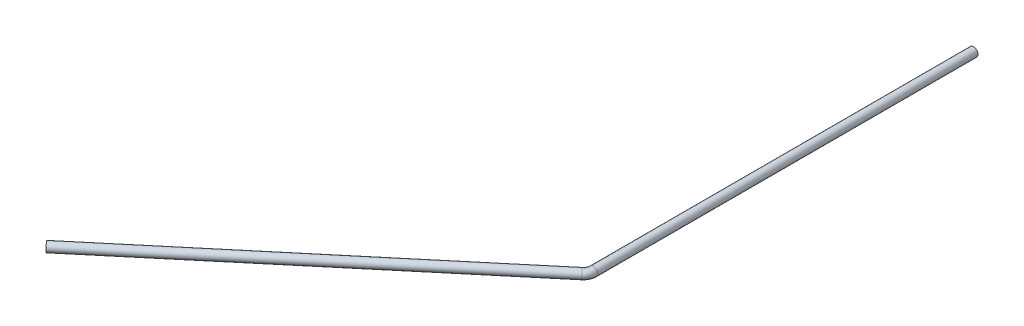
ISO-10303-21;
HEADER;
FILE_DESCRIPTION(('STEP AP214'),'2;1');
FILE_NAME('part.step','',(''),(''),'','','');
FILE_SCHEMA(('AUTOMOTIVE_DESIGN { 1 0 10303 214 1 1 1 1 }'));
ENDSEC;
DATA;
#1=APPLICATION_CONTEXT('core data for automotive mechanical design processes');
#2=APPLICATION_PROTOCOL_DEFINITION('international standard','automotive_design',2000,#1);
#3=PRODUCT_CONTEXT('',#1,'mechanical');
#4=PRODUCT('Part','Part','',(#3));
#5=PRODUCT_RELATED_PRODUCT_CATEGORY('part','',(#4));
#6=PRODUCT_DEFINITION_FORMATION('','',#4);
#7=PRODUCT_DEFINITION_CONTEXT('part definition',#1,'design');
#8=PRODUCT_DEFINITION('design','',#6,#7);
#9=PRODUCT_DEFINITION_SHAPE('','',#8);
#10=(LENGTH_UNIT() NAMED_UNIT(*) SI_UNIT(.MILLI.,.METRE.));
#11=(NAMED_UNIT(*) PLANE_ANGLE_UNIT() SI_UNIT($,.RADIAN.));
#12=(NAMED_UNIT(*) SI_UNIT($,.STERADIAN.) SOLID_ANGLE_UNIT());
#13=UNCERTAINTY_MEASURE_WITH_UNIT(LENGTH_MEASURE(1.E-05),#10,'distance_accuracy_value','');
#14=(GEOMETRIC_REPRESENTATION_CONTEXT(3) GLOBAL_UNCERTAINTY_ASSIGNED_CONTEXT((#13)) GLOBAL_UNIT_ASSIGNED_CONTEXT((#10,
#11,#12)) REPRESENTATION_CONTEXT('',''));
#15=CARTESIAN_POINT('',(0.,0.,0.));
#16=DIRECTION('',(0.,0.,1.));
#17=DIRECTION('',(1.,0.,0.));
#18=AXIS2_PLACEMENT_3D('',#15,#16,#17);
#19=CARTESIAN_POINT('',(0.,0.,0.));
#20=DIRECTION('',(0.,0.,-1.));
#21=DIRECTION('',(-1.,0.,0.));
#22=AXIS2_PLACEMENT_3D('',#19,#20,#21);
#23=PLANE('',#22);
#24=CARTESIAN_POINT('',(0.,0.,0.));
#25=DIRECTION('',(0.,0.,1.));
#26=DIRECTION('',(1.,0.,0.));
#27=AXIS2_PLACEMENT_3D('',#24,#25,#26);
#28=CIRCLE('',#27,4.);
#29=CARTESIAN_POINT('',(4.,0.,0.));
#30=VERTEX_POINT('',#29);
#31=EDGE_CURVE('E18',#30,#30,#28,.T.);
#32=ORIENTED_EDGE('',*,*,#31,.F.);
#33=EDGE_LOOP('',(#32));
#34=FACE_BOUND('',#33,.T.);
#35=ADVANCED_FACE('F15',(#34),#23,.T.);
#36=CARTESIAN_POINT('',(0.,0.,0.));
#37=DIRECTION('',(0.,0.,1.));
#38=DIRECTION('',(1.,0.,0.));
#39=AXIS2_PLACEMENT_3D('',#36,#37,#38);
#40=CYLINDRICAL_SURFACE('',#39,4.);
#41=ORIENTED_EDGE('',*,*,#31,.T.);
#42=EDGE_LOOP('',(#41));
#43=FACE_BOUND('',#42,.T.);
#44=CARTESIAN_POINT('',(0.,0.,345.803231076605));
#45=DIRECTION('',(0.,0.,1.));
#46=DIRECTION('',(1.,0.,0.));
#47=AXIS2_PLACEMENT_3D('',#44,#45,#46);
#48=CIRCLE('',#47,4.);
#49=CARTESIAN_POINT('',(4.,0.,345.803231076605));
#50=VERTEX_POINT('',#49);
#51=EDGE_CURVE('E27',#50,#50,#48,.T.);
#52=ORIENTED_EDGE('',*,*,#51,.F.);
#53=EDGE_LOOP('',(#52));
#54=FACE_BOUND('',#53,.T.);
#55=ADVANCED_FACE('F43',(#43,#54),#40,.T.);
#56=CARTESIAN_POINT('',(-268.115555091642,0.,574.975663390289));
#57=DIRECTION('',(0.766044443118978,0.,-0.64278760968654));
#58=DIRECTION('',(-0.64278760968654,0.,-0.766044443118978));
#59=AXIS2_PLACEMENT_3D('',#56,#57,#58);
#60=PLANE('',#59);
#61=CARTESIAN_POINT('',(-268.115555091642,0.,574.975663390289));
#62=DIRECTION('',(-0.766044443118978,0.,0.64278760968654));
#63=DIRECTION('',(0.64278760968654,0.,0.766044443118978));
#64=AXIS2_PLACEMENT_3D('',#61,#62,#63);
#65=CIRCLE('',#64,4.);
#66=CARTESIAN_POINT('',(-265.544404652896,0.,578.039841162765));
#67=VERTEX_POINT('',#66);
#68=EDGE_CURVE('E22',#67,#67,#65,.F.);
#69=ORIENTED_EDGE('',*,*,#68,.F.);
#70=EDGE_LOOP('',(#69));
#71=FACE_BOUND('',#70,.T.);
#72=ADVANCED_FACE('F40',(#71),#60,.F.);
#73=CARTESIAN_POINT('',(-9.,0.,345.803231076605));
#74=DIRECTION('',(0.,-1.,0.));
#75=DIRECTION('',(0.,0.,-1.));
#76=AXIS2_PLACEMENT_3D('',#73,#74,#75);
#77=TOROIDAL_SURFACE('',#76,9.00000000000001,4.);
#78=ORIENTED_EDGE('',*,*,#51,.T.);
#79=EDGE_LOOP('',(#78));
#80=FACE_BOUND('',#79,.T.);
#81=CARTESIAN_POINT('',(-3.21491151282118,0.,352.697631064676));
#82=DIRECTION('',(-0.766044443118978,0.,0.64278760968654));
#83=DIRECTION('',(0.64278760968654,0.,0.766044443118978));
#84=AXIS2_PLACEMENT_3D('',#81,#82,#83);
#85=CIRCLE('',#84,4.);
#86=CARTESIAN_POINT('',(-0.643761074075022,0.,355.761808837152));
#87=VERTEX_POINT('',#86);
#88=EDGE_CURVE('E10',#87,#87,#85,.T.);
#89=ORIENTED_EDGE('',*,*,#88,.F.);
#90=EDGE_LOOP('',(#89));
#91=FACE_BOUND('',#90,.T.);
#92=ADVANCED_FACE('F35',(#80,#91),#77,.T.);
#93=CARTESIAN_POINT('',(-3.21491151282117,0.,352.697631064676));
#94=DIRECTION('',(-0.766044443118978,0.,0.64278760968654));
#95=DIRECTION('',(0.64278760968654,0.,0.766044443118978));
#96=AXIS2_PLACEMENT_3D('',#93,#94,#95);
#97=CYLINDRICAL_SURFACE('',#96,4.);
#98=ORIENTED_EDGE('',*,*,#88,.T.);
#99=EDGE_LOOP('',(#98));
#100=FACE_BOUND('',#99,.T.);
#101=ORIENTED_EDGE('',*,*,#68,.T.);
#102=EDGE_LOOP('',(#101));
#103=FACE_BOUND('',#102,.T.);
#104=ADVANCED_FACE('F39',(#100,#103),#97,.T.);
#105=CLOSED_SHELL('',(#35,#55,#72,#92,#104));
#106=MANIFOLD_SOLID_BREP('B1',#105);
#107=ADVANCED_BREP_SHAPE_REPRESENTATION('',(#18,#106),#14);
#108=SHAPE_DEFINITION_REPRESENTATION(#9,#107);
ENDSEC;
END-ISO-10303-21;
